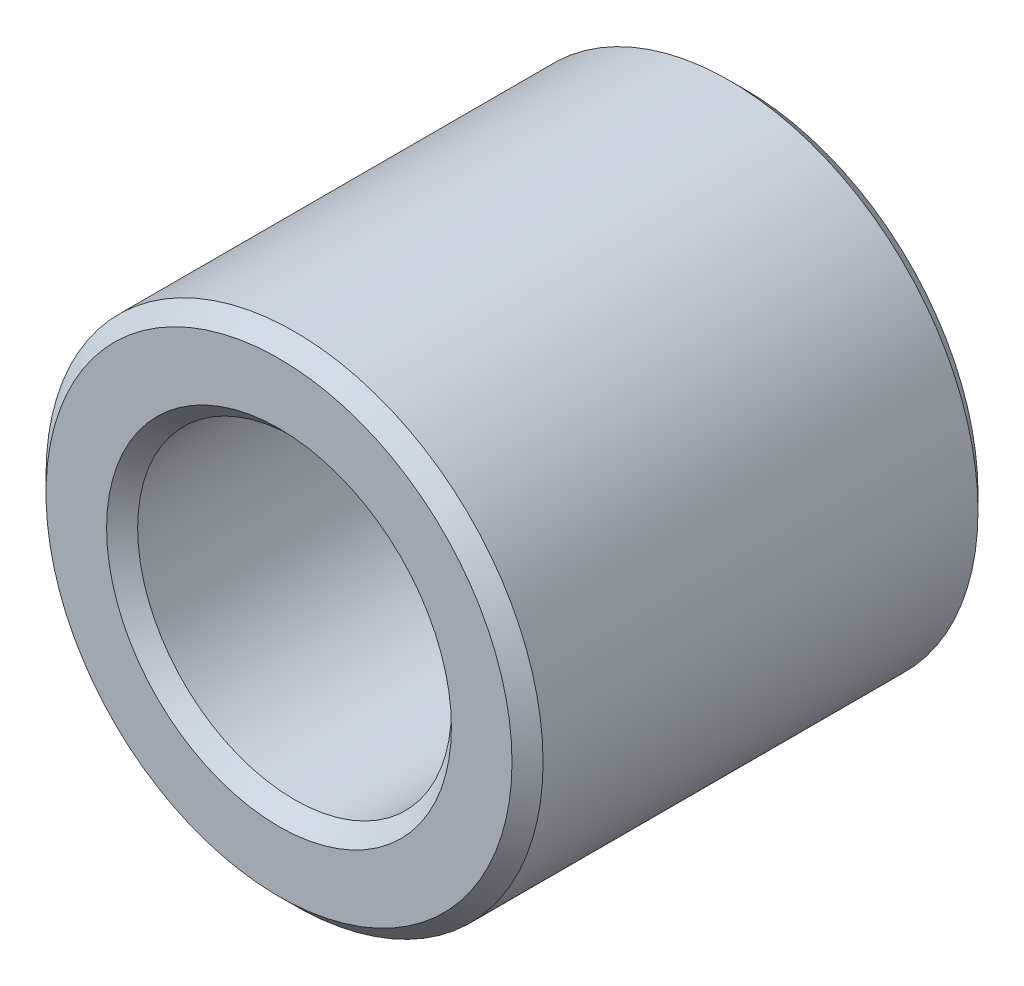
from build123d import *

# Parameters (mm, degrees)
ESQUISSE1_R        = 8
ESQUISSE1_R_2      = 5.05
BOSS_EXTRU_1_DEPTH = 15
CHANFREIN1_SIZE    = 0.5


with BuildPart() as part:
    # Esquisse1 → Boss.-Extru.1 (new body)
    with BuildSketch(Plane.XY):
        Circle(ESQUISSE1_R)
        Circle(ESQUISSE1_R_2, mode=Mode.SUBTRACT)
    extrude(amount=BOSS_EXTRU_1_DEPTH)

    # Chanfrein1
    chanfrein1_edges = [part.edges().sort_by_distance(p)[0] for p in [
        (-8, 0, 0),
        (-8, 0, 15),
        (-5.05, 0, 0),
        (-5.05, 0, 15),
    ]]
    chamfer(chanfrein1_edges, length=CHANFREIN1_SIZE)


solid = part.part
